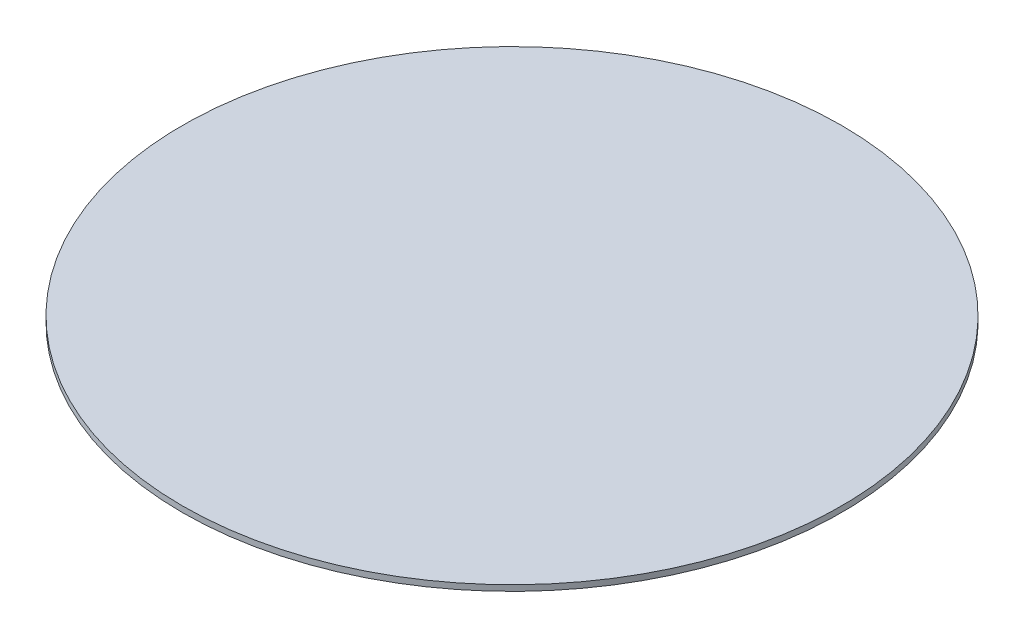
from build123d import *

# Parameters (mm, degrees)
SKETCH1_R           = 62.499999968
BOSS_EXTRUDE1_DEPTH = 1.1


with BuildPart() as part:
    # Sketch1 → Boss-Extrude1 (new body)
    with BuildSketch(Plane(origin=(0, 0, 0), x_dir=(1, 0, 0), z_dir=(0, 1, 0))):
        with Locations(Location((0, 0, 0), (0, 0, 270))):
            Circle(SKETCH1_R)
    extrude(amount=BOSS_EXTRUDE1_DEPTH)


solid = part.part
